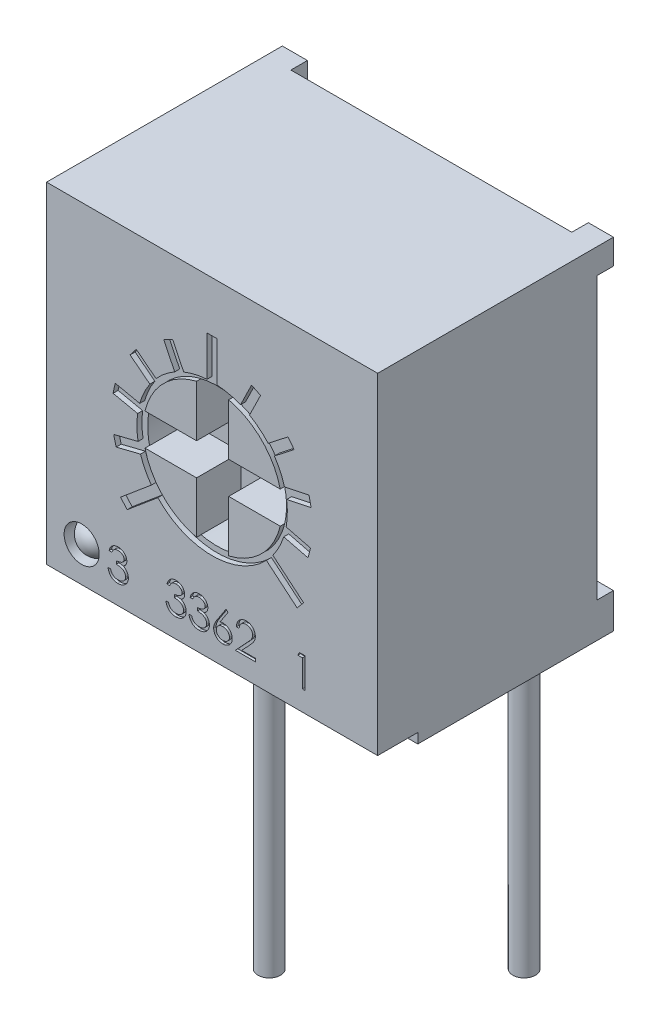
from build123d import *

# Parameters (mm, degrees)
SKETCH_1_W          = 6.6
SKETCH_1_H          = 6.6
EXTRUDE_1_DEPTH     = 4.7
SKETCH_2_R          = 1.385
CUT_EXTRUDE_1_DEPTH = 0.9
EXTRUDE_2_DEPTH     = 0.89
EXTRUDE_2_2_DEPTH   = 0.89
EXTRUDE_2_3_DEPTH   = 0.89
EXTRUDE_2_4_DEPTH   = 0.89
SKETCH_4_R          = 1.385
CUT_EXTRUDE_2_DEPTH = 0.1
SKETCH_6_R          = 0.35
CUT_EXTRUDE_3_DEPTH = 0.35
DOME_1_FACE_RADIUS  = 0.35
DOME_1_HEIGHT       = 0.35
SKETCH_13_W         = 0.53
SKETCH_13_H         = 3.9
SKETCH_13_W_2       = 2.08
EXTRUDE_4_DEPTH     = 0.2
SKETCH_14_W         = 1.04
SKETCH_14_H         = 3.9
EXTRUDE_5_DEPTH     = 0.254
SKETCH_8_W          = 5.6
SKETCH_8_H          = 0.33
CUT_EXTRUDE_4_DEPTH = 10.096093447
SKETCH_9_W          = 0.33
SKETCH_9_H          = 5.6
CUT_EXTRUDE_5_DEPTH = 9.929866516
CUT_EXTRUDE_6_DEPTH = 0.05
SKETCH_15_R         = 0.225
EXTRUDE_8_DEPTH     = 5.9
EXTRUDE_8_2_DEPTH   = 5.9
EXTRUDE_8_3_DEPTH   = 5.9


with BuildPart() as part:
    # Sketch 1 → Extrude 1 (new body)
    with BuildSketch(Plane.XY):
        Rectangle(SKETCH_1_W, SKETCH_1_H)
    extrude(amount=EXTRUDE_1_DEPTH)

    # Sketch 2 → Cut-Extrude 1 (cut)
    with BuildSketch(Plane.XY.offset(4.7)):
        Circle(SKETCH_2_R)
    extrude(amount=-CUT_EXTRUDE_1_DEPTH, mode=Mode.SUBTRACT)

    # Sketch 4 → Cut-Extrude 2 (cut)
    with BuildSketch(Plane.XY.offset(4.7)):
        with BuildLine():
            Line((-0.1, 2.296662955), (-0.1, 1.496662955))
            ThreePointArc((-0.1, 1.496662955), (-0.337426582, 1.461555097), (-0.566214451, 1.389028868))
            Line((-0.566214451, 1.389028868), (-0.785400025, 1.838425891))
            Line((-0.785400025, 1.838425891), (-0.965158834, 1.750751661))
            Line((-0.965158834, 1.750751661), (-0.74597326, 1.301354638))
            ThreePointArc((-0.74597326, 1.301354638), (-0.943980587, 1.165718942), (-1.117820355, 1.000238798))
            Line((-1.117820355, 1.000238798), (-1.511825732, 1.308069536))
            Line((-1.511825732, 1.308069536), (-1.634958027, 1.150467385))
            Line((-1.634958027, 1.150467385), (-1.24095265, 0.842636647))
            ThreePointArc((-1.24095265, 0.842636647), (-1.359461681, 0.633927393), (-1.443166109, 0.408988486))
            Line((-1.443166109, 0.408988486), (-1.93223991, 0.512944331))
            Line((-1.93223991, 0.512944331), (-1.973822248, 0.317314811))
            Line((-1.973822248, 0.317314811), (-1.484748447, 0.213358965))
            ThreePointArc((-1.484748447, 0.213358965), (-1.499771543, -0.02617861), (-1.476397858, -0.265045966))
            Line((-1.476397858, -0.265045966), (-1.961545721, -0.386006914))
            Line((-1.961545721, -0.386006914), (-1.913161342, -0.58006606))
            Line((-1.913161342, -0.58006606), (-1.428013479, -0.459105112))
            ThreePointArc((-1.428013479, -0.459105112), (-1.336509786, -0.68098575), (-1.210789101, -0.885431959))
            Line((-1.210789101, -0.885431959), (-1.823624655, -1.399662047))
            Line((-1.823624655, -1.399662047), (-1.695067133, -1.552870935))
            Line((-1.695067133, -1.552870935), (-1.082231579, -1.038640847))
            ThreePointArc((-1.082231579, -1.038640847), (0, -1.5), (1.082231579, -1.038640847))
            Line((1.082231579, -1.038640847), (1.695067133, -1.552870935))
            Line((1.695067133, -1.552870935), (1.823624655, -1.399662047))
            Line((1.823624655, -1.399662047), (1.210789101, -0.885431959))
            ThreePointArc((1.210789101, -0.885431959), (1.336509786, -0.68098575), (1.428013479, -0.459105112))
            Line((1.428013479, -0.459105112), (1.913161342, -0.58006606))
            Line((1.913161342, -0.58006606), (1.961545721, -0.386006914))
            Line((1.961545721, -0.386006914), (1.476397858, -0.265045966))
            ThreePointArc((1.476397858, -0.265045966), (1.499771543, -0.02617861), (1.484748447, 0.213358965))
            Line((1.484748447, 0.213358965), (1.973822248, 0.317314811))
            Line((1.973822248, 0.317314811), (1.93223991, 0.512944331))
            Line((1.93223991, 0.512944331), (1.443166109, 0.408988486))
            ThreePointArc((1.443166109, 0.408988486), (1.359461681, 0.633927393), (1.24095265, 0.842636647))
            Line((1.24095265, 0.842636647), (1.634958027, 1.150467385))
            Line((1.634958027, 1.150467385), (1.511825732, 1.308069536))
            Line((1.511825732, 1.308069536), (1.117820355, 1.000238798))
            ThreePointArc((1.117820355, 1.000238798), (0.943980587, 1.165718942), (0.74597326, 1.301354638))
            Line((0.74597326, 1.301354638), (0.965158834, 1.750751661))
            Line((0.965158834, 1.750751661), (0.785400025, 1.838425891))
            Line((0.785400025, 1.838425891), (0.566214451, 1.389028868))
            ThreePointArc((0.566214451, 1.389028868), (0.337426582, 1.461555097), (0.1, 1.496662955))
            Line((0.1, 1.496662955), (0.1, 2.296662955))
            Line((0.1, 2.296662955), (-0.1, 2.296662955))
        make_face()
        Circle(SKETCH_4_R, mode=Mode.SUBTRACT)
    extrude(amount=-CUT_EXTRUDE_2_DEPTH, mode=Mode.SUBTRACT)

    # Sketch 6 → Cut-Extrude 3 (cut)
    with BuildSketch(Plane.XY.offset(4.7)):
        with Locations((-2.6, -2.6)):
            Circle(SKETCH_6_R)
    extrude(amount=-CUT_EXTRUDE_3_DEPTH, mode=Mode.SUBTRACT)

    # Dome 1: a dome of height H over a round flat face of radius A is a cap of a sphere of radius (A * A + H * H) / (2 * H)
    dome_1_r = (DOME_1_FACE_RADIUS * DOME_1_FACE_RADIUS + DOME_1_HEIGHT * DOME_1_HEIGHT) / (2 * DOME_1_HEIGHT)
    dome_1_base = Plane((-2.6, -2.6, 4.35), z_dir=(0, 0, 1))
    with Locations(dome_1_base.offset(DOME_1_HEIGHT - dome_1_r)):
        dome_1_ball = Sphere(dome_1_r, mode=Mode.PRIVATE)
    add(split(dome_1_ball, bisect_by=dome_1_base, keep=Keep.TOP, mode=Mode.PRIVATE))

    # Sketch 13 → Extrude 4 (add)
    with BuildSketch(Plane.XZ.offset(3.3)):
        with Locations((-3.035, 1.95)):
            Rectangle(SKETCH_13_W, SKETCH_13_H)
        with Locations((-1.27, 1.95)):
            Rectangle(SKETCH_13_W_2, SKETCH_13_H)
        with Locations((1.27, 1.95)):
            Rectangle(SKETCH_13_W_2, SKETCH_13_H)
        with Locations((3.035, 1.95)):
            Rectangle(SKETCH_13_W, SKETCH_13_H)
    extrude(amount=EXTRUDE_4_DEPTH)

    # Sketch 14 → Extrude 5 (add)
    with BuildSketch(Plane(origin=(0, -3.5, 0), x_dir=(-1, 0, 0), z_dir=(0, -1, 0))):
        with Locations((1.79, -1.95)):
            Rectangle(SKETCH_14_W, SKETCH_14_H)
        with Locations((-1.79, -1.95)):
            Rectangle(SKETCH_14_W, SKETCH_14_H)
    extrude(amount=EXTRUDE_5_DEPTH)

    # Sketch 8 → Cut-Extrude 4 (cut, through all)
    with BuildSketch(Plane(origin=(0, 3.3, 0), x_dir=(1, 0, 0), z_dir=(0, 1, 0))):
        with Locations((0, -0.165)):
            Rectangle(SKETCH_8_W, SKETCH_8_H)
    extrude(amount=-CUT_EXTRUDE_4_DEPTH, mode=Mode.SUBTRACT)

    # Sketch 9 → Cut-Extrude 5 (cut, through all)
    with BuildSketch(Plane(origin=(3.3, 0, 0), x_dir=(0, 0, -1), z_dir=(1, 0, 0))):
        with Locations((-0.165, 0)):
            Rectangle(SKETCH_9_W, SKETCH_9_H)
    extrude(amount=-CUT_EXTRUDE_5_DEPTH, mode=Mode.SUBTRACT)

    # Sketch 11 → Cut-Extrude 6 (cut)
    # profile 1 of 6: a face of its own
    with BuildSketch(Plane.XY.offset(4.7)):
        with BuildLine():
            Line((-2, -2.438461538), (-2.053846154, -2.438461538))
            add(Edge.make_bspline(
                [(-2.053846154, -2.438461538), (-2.052387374, -2.432421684), (-2.049535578, -2.420614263), (-2.043587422, -2.403744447), (-2.03710755, -2.387780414), (-2.029326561, -2.373021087), (-2.020839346, -2.359169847), (-2.011115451, -2.346540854), (-2.000603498, -2.334812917), (-1.988976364, -2.324404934), (-1.976782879, -2.31498018), (-1.96385123, -2.306944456), (-1.950441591, -2.300031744), (-1.936461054, -2.294336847), (-1.921867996, -2.290046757), (-1.906794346, -2.286934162), (-1.891200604, -2.284912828), (-1.880615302, -2.284715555), (-1.875240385, -2.284615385)],
                knots=[0, 0, 0, 0, 1.162005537, 2.271625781, 3.343758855, 4.383309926, 5.390229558, 6.379919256, 7.361854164, 8.333198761, 9.295911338, 10.242430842, 11.177959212, 12.116337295, 13.062827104, 14.020064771, 14.994644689, 16, 16, 16, 16], degree=3))
            add(Edge.make_bspline(
                [(-1.875240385, -2.284615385), (-1.867409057, -2.284851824), (-1.851917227, -2.285319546), (-1.829157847, -2.289590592), (-1.807210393, -2.296349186), (-1.786315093, -2.305687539), (-1.766906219, -2.317205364), (-1.749637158, -2.330913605), (-1.734741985, -2.346547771), (-1.722245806, -2.36381621), (-1.712461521, -2.382271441), (-1.705246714, -2.401265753), (-1.700854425, -2.420754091), (-1.700285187, -2.433912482), (-1.7, -2.440504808)],
                knots=[0, 0, 0, 0, 1.083050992, 2.142477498, 3.193116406, 4.255571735, 5.30263384, 6.308962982, 7.297363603, 8.282367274, 9.249857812, 10.179914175, 11.08814088, 12, 12, 12, 12], degree=3))
            add(Edge.make_bspline(
                [(-1.7, -2.440504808), (-1.700199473, -2.44684883), (-1.70058981, -2.459263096), (-1.703904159, -2.477386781), (-1.709481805, -2.494468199), (-1.71720805, -2.510579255), (-1.727209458, -2.525617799), (-1.739324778, -2.539617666), (-1.75363952, -2.55264095), (-1.764487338, -2.560101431), (-1.770072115, -2.563942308)],
                knots=[0, 0, 0, 0, 1.024540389, 2.004866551, 2.965041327, 3.920577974, 4.882998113, 5.874504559, 6.905732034, 8, 8, 8, 8], degree=3))
            add(Edge.make_bspline(
                [(-1.770072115, -2.563942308), (-1.763689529, -2.56702428), (-1.751043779, -2.573130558), (-1.733806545, -2.585105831), (-1.71815891, -2.598932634), (-1.709432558, -2.609722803), (-1.705048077, -2.615144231)],
                knots=[0, 0, 0, 0, 1.015518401, 2.012035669, 3.001164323, 4, 4, 4, 4], degree=3))
            add(Edge.make_bspline(
                [(-1.705048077, -2.615144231), (-1.70216099, -2.619096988), (-1.696434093, -2.626937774), (-1.689365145, -2.639544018), (-1.682952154, -2.652289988), (-1.677954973, -2.665517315), (-1.674085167, -2.679072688), (-1.67131899, -2.692979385), (-1.669600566, -2.70724876), (-1.669354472, -2.716902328), (-1.669230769, -2.721754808)],
                knots=[0, 0, 0, 0, 1.025084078, 2.033381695, 3.024893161, 4.013698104, 4.991890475, 5.976764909, 6.982997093, 8, 8, 8, 8], degree=3))
            add(Edge.make_bspline(
                [(-1.669230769, -2.721754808), (-1.6695384, -2.730156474), (-1.670152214, -2.746920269), (-1.675638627, -2.771687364), (-1.684143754, -2.79589745), (-1.696222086, -2.819053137), (-1.71094223, -2.840718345), (-1.728454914, -2.860102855), (-1.748561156, -2.876765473), (-1.770984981, -2.890687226), (-1.795279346, -2.901816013), (-1.821263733, -2.909540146), (-1.848563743, -2.914570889), (-1.867284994, -2.915110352), (-1.876802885, -2.915384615)],
                knots=[0, 0, 0, 0, 0.955779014, 1.907060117, 2.875433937, 3.871313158, 4.872415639, 5.851225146, 6.836215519, 7.83643374, 8.849228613, 9.86973379, 10.916971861, 12, 12, 12, 12], degree=3))
            add(Edge.make_bspline(
                [(-1.876802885, -2.915384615), (-1.883217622, -2.915235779), (-1.895839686, -2.914942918), (-1.914395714, -2.912940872), (-1.932108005, -2.9092843), (-1.949000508, -2.904363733), (-1.965088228, -2.898125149), (-1.980322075, -2.890356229), (-1.994795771, -2.881217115), (-2.008372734, -2.870599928), (-2.021051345, -2.858723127), (-2.03249467, -2.845375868), (-2.042893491, -2.830804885), (-2.051969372, -2.814840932), (-2.060135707, -2.797690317), (-2.066852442, -2.779133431), (-2.072764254, -2.75933617), (-2.075512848, -2.745539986), (-2.076923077, -2.738461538)],
                knots=[0, 0, 0, 0, 1.048658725, 2.063410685, 3.046034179, 4.001477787, 4.936774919, 5.862367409, 6.792675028, 7.730719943, 8.675894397, 9.627829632, 10.600096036, 11.597688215, 12.626045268, 13.701542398, 14.82072376, 16, 16, 16, 16], degree=3))
            Line((-2.076923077, -2.738461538), (-2.023076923, -2.738461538))
            add(Edge.make_bspline(
                [(-2.023076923, -2.738461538), (-2.021674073, -2.743081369), (-2.018945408, -2.752067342), (-2.014300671, -2.764999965), (-2.009008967, -2.776855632), (-2.003332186, -2.78772131), (-1.997370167, -2.797704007), (-1.990699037, -2.806539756), (-1.983812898, -2.814616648), (-1.978622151, -2.819167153), (-1.976081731, -2.821394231)],
                knots=[0, 0, 0, 0, 1.198163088, 2.33053128, 3.407730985, 4.417276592, 5.372219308, 6.28897303, 7.162600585, 8, 8, 8, 8], degree=3))
            add(Edge.make_bspline(
                [(-1.976081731, -2.821394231), (-1.972722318, -2.823984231), (-1.966013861, -2.829156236), (-1.955082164, -2.835756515), (-1.943585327, -2.841475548), (-1.93127424, -2.845844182), (-1.918414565, -2.84954321), (-1.904798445, -2.85196387), (-1.890546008, -2.853624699), (-1.880814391, -2.853771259), (-1.875841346, -2.853846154)],
                knots=[0, 0, 0, 0, 0.946170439, 1.889420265, 2.845303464, 3.807233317, 4.801018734, 5.828864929, 6.890507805, 8, 8, 8, 8], degree=3))
            add(Edge.make_bspline(
                [(-1.875841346, -2.853846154), (-1.87022646, -2.85374057), (-1.859247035, -2.85353411), (-1.843226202, -2.851635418), (-1.827984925, -2.848870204), (-1.813692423, -2.844599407), (-1.800161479, -2.839322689), (-1.787581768, -2.832697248), (-1.77578815, -2.824923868), (-1.76493168, -2.816088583), (-1.755169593, -2.806416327), (-1.746574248, -2.7962998), (-1.739267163, -2.785781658), (-1.733372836, -2.774803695), (-1.728718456, -2.76341137), (-1.725549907, -2.751572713), (-1.72334679, -2.739384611), (-1.723167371, -2.731099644), (-1.723076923, -2.726923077)],
                knots=[0, 0, 0, 0, 1.217147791, 2.380027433, 3.494444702, 4.572153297, 5.609568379, 6.639424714, 7.649109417, 8.668170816, 9.669597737, 10.625200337, 11.543417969, 12.441394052, 13.322311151, 14.205496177, 15.095365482, 16, 16, 16, 16], degree=3))
            add(Edge.make_bspline(
                [(-1.723076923, -2.726923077), (-1.72333926, -2.721332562), (-1.72386263, -2.710179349), (-1.727858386, -2.693770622), (-1.734430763, -2.677960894), (-1.743631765, -2.663019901), (-1.754832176, -2.649172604), (-1.767923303, -2.636817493), (-1.783013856, -2.62662262), (-1.796902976, -2.61957885), (-1.809205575, -2.614772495), (-1.819733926, -2.611571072), (-1.831520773, -2.60886016), (-1.844423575, -2.606338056), (-1.858539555, -2.604191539), (-1.873853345, -2.602401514), (-1.890368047, -2.600969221), (-1.901800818, -2.600329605), (-1.907692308, -2.6)],
                knots=[0, 0, 0, 0, 1.07054697, 2.135767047, 3.216561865, 4.33974944, 5.486079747, 6.621378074, 7.775625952, 8.963672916, 9.598146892, 10.304877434, 11.070270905, 11.915000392, 12.823868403, 13.805723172, 14.86925407, 16, 16, 16, 16], degree=3))
            Line((-1.907692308, -2.6), (-1.907692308, -2.538461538))
            add(Edge.make_bspline(
                [(-1.907692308, -2.538461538), (-1.900269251, -2.538335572), (-1.885729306, -2.538088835), (-1.864490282, -2.535104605), (-1.844180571, -2.530976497), (-1.825250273, -2.524653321), (-1.807996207, -2.51730927), (-1.793027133, -2.508763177), (-1.780552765, -2.499263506), (-1.770633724, -2.48866363), (-1.76317157, -2.477295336), (-1.757715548, -2.465446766), (-1.754492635, -2.45301407), (-1.754062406, -2.44452927), (-1.753846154, -2.440264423)],
                knots=[0, 0, 0, 0, 1.321986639, 2.589447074, 3.816329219, 5.01088745, 6.139805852, 7.153945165, 8.075214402, 8.924034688, 9.728124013, 10.488707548, 11.240355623, 12, 12, 12, 12], degree=3))
            add(Edge.make_bspline(
                [(-1.753846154, -2.440264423), (-1.753917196, -2.437131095), (-1.75405853, -2.430897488), (-1.755840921, -2.421790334), (-1.758519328, -2.4129616), (-1.762201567, -2.404448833), (-1.767130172, -2.396311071), (-1.773028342, -2.388478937), (-1.780051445, -2.380997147), (-1.788099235, -2.374023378), (-1.796741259, -2.367377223), (-1.806212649, -2.361734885), (-1.816227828, -2.356910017), (-1.826797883, -2.352931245), (-1.837957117, -2.349938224), (-1.849653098, -2.347789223), (-1.861908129, -2.346445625), (-1.870268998, -2.346252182), (-1.874519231, -2.346153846)],
                knots=[0, 0, 0, 0, 0.884392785, 1.759457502, 2.611959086, 3.489218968, 4.37281399, 5.2945488, 6.255912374, 7.266815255, 8.301784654, 9.332968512, 10.37626691, 11.440494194, 12.520033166, 13.637162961, 14.798855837, 16, 16, 16, 16], degree=3))
            add(Edge.make_bspline(
                [(-1.874519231, -2.346153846), (-1.881350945, -2.346392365), (-1.894694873, -2.346858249), (-1.913931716, -2.350938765), (-1.93181503, -2.357449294), (-1.945484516, -2.365220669), (-1.955578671, -2.372892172), (-1.962791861, -2.379592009), (-1.969875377, -2.387037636), (-1.976363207, -2.395687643), (-1.98292446, -2.404956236), (-1.988897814, -2.415314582), (-1.994702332, -2.426492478), (-1.998199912, -2.434394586), (-2, -2.438461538)],
                knots=[0, 0, 0, 0, 1.472543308, 2.876219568, 4.221790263, 5.565193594, 6.249813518, 6.953379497, 7.687249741, 8.463570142, 9.283606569, 10.136032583, 11.040678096, 12, 12, 12, 12], degree=3))
        make_face()
    # profile 2 of 6: a face of its own
    with BuildSketch(Plane.XY.offset(4.7)):
        with BuildLine():
            Line((-0.846153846, -2.438461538), (-0.9, -2.438461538))
            add(Edge.make_bspline(
                [(-0.9, -2.438461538), (-0.89854122, -2.432421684), (-0.895689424, -2.420614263), (-0.889741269, -2.403744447), (-0.883261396, -2.387780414), (-0.875480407, -2.373021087), (-0.866993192, -2.359169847), (-0.857269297, -2.346540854), (-0.846757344, -2.334812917), (-0.83513021, -2.324404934), (-0.822936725, -2.31498018), (-0.810005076, -2.306944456), (-0.796595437, -2.300031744), (-0.7826149, -2.294336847), (-0.768021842, -2.290046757), (-0.752948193, -2.286934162), (-0.73735445, -2.284912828), (-0.726769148, -2.284715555), (-0.721394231, -2.284615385)],
                knots=[0, 0, 0, 0, 1.162005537, 2.271625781, 3.343758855, 4.383309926, 5.390229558, 6.379919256, 7.361854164, 8.333198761, 9.295911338, 10.242430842, 11.177959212, 12.116337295, 13.062827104, 14.020064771, 14.994644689, 16, 16, 16, 16], degree=3))
            add(Edge.make_bspline(
                [(-0.721394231, -2.284615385), (-0.713562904, -2.284851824), (-0.698071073, -2.285319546), (-0.675311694, -2.289590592), (-0.653364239, -2.296349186), (-0.632468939, -2.305687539), (-0.613060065, -2.317205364), (-0.595791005, -2.330913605), (-0.580895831, -2.346547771), (-0.568399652, -2.36381621), (-0.558615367, -2.382271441), (-0.55140056, -2.401265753), (-0.547008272, -2.420754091), (-0.546439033, -2.433912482), (-0.546153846, -2.440504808)],
                knots=[0, 0, 0, 0, 1.083050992, 2.142477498, 3.193116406, 4.255571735, 5.30263384, 6.308962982, 7.297363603, 8.282367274, 9.249857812, 10.179914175, 11.08814088, 12, 12, 12, 12], degree=3))
            add(Edge.make_bspline(
                [(-0.546153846, -2.440504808), (-0.546353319, -2.44684883), (-0.546743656, -2.459263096), (-0.550058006, -2.477386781), (-0.555635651, -2.494468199), (-0.563361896, -2.510579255), (-0.573363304, -2.525617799), (-0.585478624, -2.539617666), (-0.599793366, -2.55264095), (-0.610641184, -2.560101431), (-0.616225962, -2.563942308)],
                knots=[0, 0, 0, 0, 1.024540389, 2.004866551, 2.965041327, 3.920577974, 4.882998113, 5.874504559, 6.905732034, 8, 8, 8, 8], degree=3))
            add(Edge.make_bspline(
                [(-0.616225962, -2.563942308), (-0.609843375, -2.56702428), (-0.597197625, -2.573130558), (-0.579960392, -2.585105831), (-0.564312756, -2.598932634), (-0.555586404, -2.609722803), (-0.551201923, -2.615144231)],
                knots=[0, 0, 0, 0, 1.015518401, 2.012035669, 3.001164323, 4, 4, 4, 4], degree=3))
            add(Edge.make_bspline(
                [(-0.551201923, -2.615144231), (-0.548314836, -2.619096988), (-0.542587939, -2.626937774), (-0.535518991, -2.639544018), (-0.529106, -2.652289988), (-0.524108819, -2.665517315), (-0.520239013, -2.679072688), (-0.517472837, -2.692979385), (-0.515754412, -2.70724876), (-0.515508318, -2.716902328), (-0.515384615, -2.721754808)],
                knots=[0, 0, 0, 0, 1.025084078, 2.033381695, 3.024893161, 4.013698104, 4.991890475, 5.976764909, 6.982997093, 8, 8, 8, 8], degree=3))
            add(Edge.make_bspline(
                [(-0.515384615, -2.721754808), (-0.515692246, -2.730156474), (-0.51630606, -2.746920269), (-0.521792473, -2.771687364), (-0.5302976, -2.79589745), (-0.542375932, -2.819053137), (-0.557096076, -2.840718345), (-0.57460876, -2.860102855), (-0.594715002, -2.876765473), (-0.617138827, -2.890687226), (-0.641433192, -2.901816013), (-0.667417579, -2.909540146), (-0.694717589, -2.914570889), (-0.71343884, -2.915110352), (-0.722956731, -2.915384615)],
                knots=[0, 0, 0, 0, 0.955779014, 1.907060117, 2.875433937, 3.871313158, 4.872415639, 5.851225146, 6.836215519, 7.83643374, 8.849228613, 9.86973379, 10.916971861, 12, 12, 12, 12], degree=3))
            add(Edge.make_bspline(
                [(-0.722956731, -2.915384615), (-0.729371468, -2.915235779), (-0.741993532, -2.914942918), (-0.76054956, -2.912940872), (-0.778261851, -2.9092843), (-0.795154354, -2.904363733), (-0.811242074, -2.898125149), (-0.826475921, -2.890356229), (-0.840949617, -2.881217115), (-0.85452658, -2.870599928), (-0.867205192, -2.858723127), (-0.878648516, -2.845375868), (-0.889047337, -2.830804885), (-0.898123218, -2.814840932), (-0.906289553, -2.797690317), (-0.913006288, -2.779133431), (-0.9189181, -2.75933617), (-0.921666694, -2.745539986), (-0.923076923, -2.738461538)],
                knots=[0, 0, 0, 0, 1.048658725, 2.063410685, 3.046034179, 4.001477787, 4.936774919, 5.862367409, 6.792675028, 7.730719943, 8.675894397, 9.627829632, 10.600096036, 11.597688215, 12.626045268, 13.701542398, 14.82072376, 16, 16, 16, 16], degree=3))
            Line((-0.923076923, -2.738461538), (-0.869230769, -2.738461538))
            add(Edge.make_bspline(
                [(-0.869230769, -2.738461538), (-0.867827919, -2.743081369), (-0.865099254, -2.752067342), (-0.860454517, -2.764999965), (-0.855162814, -2.776855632), (-0.849486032, -2.78772131), (-0.843524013, -2.797704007), (-0.836852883, -2.806539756), (-0.829966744, -2.814616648), (-0.824775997, -2.819167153), (-0.822235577, -2.821394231)],
                knots=[0, 0, 0, 0, 1.198163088, 2.33053128, 3.407730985, 4.417276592, 5.372219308, 6.28897303, 7.162600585, 8, 8, 8, 8], degree=3))
            add(Edge.make_bspline(
                [(-0.822235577, -2.821394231), (-0.818876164, -2.823984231), (-0.812167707, -2.829156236), (-0.801236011, -2.835756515), (-0.789739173, -2.841475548), (-0.777428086, -2.845844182), (-0.764568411, -2.84954321), (-0.750952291, -2.85196387), (-0.736699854, -2.853624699), (-0.726968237, -2.853771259), (-0.721995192, -2.853846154)],
                knots=[0, 0, 0, 0, 0.946170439, 1.889420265, 2.845303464, 3.807233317, 4.801018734, 5.828864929, 6.890507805, 8, 8, 8, 8], degree=3))
            add(Edge.make_bspline(
                [(-0.721995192, -2.853846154), (-0.716380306, -2.85374057), (-0.705400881, -2.85353411), (-0.689380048, -2.851635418), (-0.674138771, -2.848870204), (-0.65984627, -2.844599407), (-0.646315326, -2.839322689), (-0.633735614, -2.832697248), (-0.621941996, -2.824923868), (-0.611085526, -2.816088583), (-0.601323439, -2.806416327), (-0.592728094, -2.7962998), (-0.585421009, -2.785781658), (-0.579526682, -2.774803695), (-0.574872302, -2.76341137), (-0.571703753, -2.751572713), (-0.569500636, -2.739384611), (-0.569321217, -2.731099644), (-0.569230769, -2.726923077)],
                knots=[0, 0, 0, 0, 1.217147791, 2.380027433, 3.494444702, 4.572153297, 5.609568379, 6.639424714, 7.649109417, 8.668170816, 9.669597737, 10.625200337, 11.543417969, 12.441394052, 13.322311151, 14.205496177, 15.095365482, 16, 16, 16, 16], degree=3))
            add(Edge.make_bspline(
                [(-0.569230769, -2.726923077), (-0.569493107, -2.721332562), (-0.570016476, -2.710179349), (-0.574012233, -2.693770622), (-0.580584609, -2.677960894), (-0.589785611, -2.663019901), (-0.600986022, -2.649172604), (-0.614077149, -2.636817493), (-0.629167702, -2.62662262), (-0.643056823, -2.61957885), (-0.655359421, -2.614772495), (-0.665887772, -2.611571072), (-0.677674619, -2.60886016), (-0.690577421, -2.606338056), (-0.704693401, -2.604191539), (-0.720007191, -2.602401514), (-0.736521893, -2.600969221), (-0.747954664, -2.600329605), (-0.753846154, -2.6)],
                knots=[0, 0, 0, 0, 1.07054697, 2.135767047, 3.216561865, 4.33974944, 5.486079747, 6.621378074, 7.775625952, 8.963672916, 9.598146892, 10.304877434, 11.070270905, 11.915000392, 12.823868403, 13.805723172, 14.86925407, 16, 16, 16, 16], degree=3))
            Line((-0.753846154, -2.6), (-0.753846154, -2.538461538))
            add(Edge.make_bspline(
                [(-0.753846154, -2.538461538), (-0.746423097, -2.538335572), (-0.731883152, -2.538088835), (-0.710644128, -2.535104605), (-0.690334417, -2.530976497), (-0.671404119, -2.524653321), (-0.654150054, -2.51730927), (-0.639180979, -2.508763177), (-0.626706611, -2.499263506), (-0.61678757, -2.48866363), (-0.609325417, -2.477295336), (-0.603869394, -2.465446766), (-0.600646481, -2.45301407), (-0.600216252, -2.44452927), (-0.6, -2.440264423)],
                knots=[0, 0, 0, 0, 1.321986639, 2.589447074, 3.816329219, 5.01088745, 6.139805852, 7.153945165, 8.075214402, 8.924034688, 9.728124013, 10.488707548, 11.240355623, 12, 12, 12, 12], degree=3))
            add(Edge.make_bspline(
                [(-0.6, -2.440264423), (-0.600071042, -2.437131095), (-0.600212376, -2.430897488), (-0.601994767, -2.421790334), (-0.604673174, -2.4129616), (-0.608355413, -2.404448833), (-0.613284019, -2.396311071), (-0.619182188, -2.388478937), (-0.626205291, -2.380997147), (-0.634253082, -2.374023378), (-0.642895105, -2.367377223), (-0.652366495, -2.361734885), (-0.662381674, -2.356910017), (-0.672951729, -2.352931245), (-0.684110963, -2.349938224), (-0.695806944, -2.347789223), (-0.708061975, -2.346445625), (-0.716422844, -2.346252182), (-0.720673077, -2.346153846)],
                knots=[0, 0, 0, 0, 0.884392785, 1.759457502, 2.611959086, 3.489218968, 4.37281399, 5.2945488, 6.255912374, 7.266815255, 8.301784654, 9.332968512, 10.37626691, 11.440494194, 12.520033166, 13.637162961, 14.798855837, 16, 16, 16, 16], degree=3))
            add(Edge.make_bspline(
                [(-0.720673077, -2.346153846), (-0.727504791, -2.346392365), (-0.740848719, -2.346858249), (-0.760085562, -2.350938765), (-0.777968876, -2.357449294), (-0.791638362, -2.365220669), (-0.801732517, -2.372892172), (-0.808945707, -2.379592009), (-0.816029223, -2.387037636), (-0.822517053, -2.395687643), (-0.829078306, -2.404956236), (-0.83505166, -2.415314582), (-0.840856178, -2.426492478), (-0.844353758, -2.434394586), (-0.846153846, -2.438461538)],
                knots=[0, 0, 0, 0, 1.472543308, 2.876219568, 4.221790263, 5.565193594, 6.249813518, 6.953379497, 7.687249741, 8.463570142, 9.283606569, 10.136032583, 11.040678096, 12, 12, 12, 12], degree=3))
        make_face()
    # profile 3 of 6: a face of its own
    with BuildSketch(Plane.XY.offset(4.7)):
        with BuildLine():
            Line((-0.384615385, -2.438461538), (-0.438461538, -2.438461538))
            add(Edge.make_bspline(
                [(-0.438461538, -2.438461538), (-0.437002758, -2.432421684), (-0.434150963, -2.420614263), (-0.428202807, -2.403744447), (-0.421722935, -2.387780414), (-0.413941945, -2.373021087), (-0.40545473, -2.359169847), (-0.395730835, -2.346540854), (-0.385218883, -2.334812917), (-0.373591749, -2.324404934), (-0.361398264, -2.31498018), (-0.348466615, -2.306944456), (-0.335056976, -2.300031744), (-0.321076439, -2.294336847), (-0.306483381, -2.290046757), (-0.291409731, -2.286934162), (-0.275815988, -2.284912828), (-0.265230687, -2.284715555), (-0.259855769, -2.284615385)],
                knots=[0, 0, 0, 0, 1.162005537, 2.271625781, 3.343758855, 4.383309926, 5.390229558, 6.379919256, 7.361854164, 8.333198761, 9.295911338, 10.242430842, 11.177959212, 12.116337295, 13.062827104, 14.020064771, 14.994644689, 16, 16, 16, 16], degree=3))
            add(Edge.make_bspline(
                [(-0.259855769, -2.284615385), (-0.252024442, -2.284851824), (-0.236532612, -2.285319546), (-0.213773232, -2.289590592), (-0.191825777, -2.296349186), (-0.170930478, -2.305687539), (-0.151521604, -2.317205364), (-0.134252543, -2.330913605), (-0.11935737, -2.346547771), (-0.106861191, -2.36381621), (-0.097076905, -2.382271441), (-0.089862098, -2.401265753), (-0.08546981, -2.420754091), (-0.084900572, -2.433912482), (-0.084615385, -2.440504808)],
                knots=[0, 0, 0, 0, 1.083050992, 2.142477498, 3.193116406, 4.255571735, 5.30263384, 6.308962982, 7.297363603, 8.282367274, 9.249857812, 10.179914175, 11.08814088, 12, 12, 12, 12], degree=3))
            add(Edge.make_bspline(
                [(-0.084615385, -2.440504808), (-0.084814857, -2.44684883), (-0.085205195, -2.459263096), (-0.088519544, -2.477386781), (-0.094097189, -2.494468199), (-0.101823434, -2.510579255), (-0.111824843, -2.525617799), (-0.123940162, -2.539617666), (-0.138254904, -2.55264095), (-0.149102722, -2.560101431), (-0.1546875, -2.563942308)],
                knots=[0, 0, 0, 0, 1.024540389, 2.004866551, 2.965041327, 3.920577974, 4.882998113, 5.874504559, 6.905732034, 8, 8, 8, 8], degree=3))
            add(Edge.make_bspline(
                [(-0.1546875, -2.563942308), (-0.148304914, -2.56702428), (-0.135659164, -2.573130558), (-0.11842193, -2.585105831), (-0.102774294, -2.598932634), (-0.094047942, -2.609722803), (-0.089663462, -2.615144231)],
                knots=[0, 0, 0, 0, 1.015518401, 2.012035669, 3.001164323, 4, 4, 4, 4], degree=3))
            add(Edge.make_bspline(
                [(-0.089663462, -2.615144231), (-0.086776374, -2.619096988), (-0.081049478, -2.626937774), (-0.073980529, -2.639544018), (-0.067567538, -2.652289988), (-0.062570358, -2.665517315), (-0.058700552, -2.679072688), (-0.055934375, -2.692979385), (-0.054215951, -2.70724876), (-0.053969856, -2.716902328), (-0.053846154, -2.721754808)],
                knots=[0, 0, 0, 0, 1.025084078, 2.033381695, 3.024893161, 4.013698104, 4.991890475, 5.976764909, 6.982997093, 8, 8, 8, 8], degree=3))
            add(Edge.make_bspline(
                [(-0.053846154, -2.721754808), (-0.054153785, -2.730156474), (-0.054767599, -2.746920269), (-0.060254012, -2.771687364), (-0.068759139, -2.79589745), (-0.08083747, -2.819053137), (-0.095557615, -2.840718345), (-0.113070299, -2.860102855), (-0.13317654, -2.876765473), (-0.155600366, -2.890687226), (-0.179894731, -2.901816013), (-0.205879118, -2.909540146), (-0.233179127, -2.914570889), (-0.251900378, -2.915110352), (-0.261418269, -2.915384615)],
                knots=[0, 0, 0, 0, 0.955779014, 1.907060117, 2.875433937, 3.871313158, 4.872415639, 5.851225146, 6.836215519, 7.83643374, 8.849228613, 9.86973379, 10.916971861, 12, 12, 12, 12], degree=3))
            add(Edge.make_bspline(
                [(-0.261418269, -2.915384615), (-0.267833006, -2.915235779), (-0.28045507, -2.914942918), (-0.299011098, -2.912940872), (-0.31672339, -2.9092843), (-0.333615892, -2.904363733), (-0.349703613, -2.898125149), (-0.364937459, -2.890356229), (-0.379411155, -2.881217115), (-0.392988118, -2.870599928), (-0.40566673, -2.858723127), (-0.417110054, -2.845375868), (-0.427508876, -2.830804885), (-0.436584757, -2.814840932), (-0.444751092, -2.797690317), (-0.451467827, -2.779133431), (-0.457379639, -2.75933617), (-0.460128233, -2.745539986), (-0.461538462, -2.738461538)],
                knots=[0, 0, 0, 0, 1.048658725, 2.063410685, 3.046034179, 4.001477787, 4.936774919, 5.862367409, 6.792675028, 7.730719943, 8.675894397, 9.627829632, 10.600096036, 11.597688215, 12.626045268, 13.701542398, 14.82072376, 16, 16, 16, 16], degree=3))
            Line((-0.461538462, -2.738461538), (-0.407692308, -2.738461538))
            add(Edge.make_bspline(
                [(-0.407692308, -2.738461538), (-0.406289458, -2.743081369), (-0.403560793, -2.752067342), (-0.398916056, -2.764999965), (-0.393624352, -2.776855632), (-0.387947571, -2.78772131), (-0.381985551, -2.797704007), (-0.375314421, -2.806539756), (-0.368428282, -2.814616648), (-0.363237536, -2.819167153), (-0.360697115, -2.821394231)],
                knots=[0, 0, 0, 0, 1.198163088, 2.33053128, 3.407730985, 4.417276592, 5.372219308, 6.28897303, 7.162600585, 8, 8, 8, 8], degree=3))
            add(Edge.make_bspline(
                [(-0.360697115, -2.821394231), (-0.357337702, -2.823984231), (-0.350629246, -2.829156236), (-0.339697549, -2.835756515), (-0.328200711, -2.841475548), (-0.315889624, -2.845844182), (-0.303029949, -2.84954321), (-0.28941383, -2.85196387), (-0.275161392, -2.853624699), (-0.265429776, -2.853771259), (-0.260456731, -2.853846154)],
                knots=[0, 0, 0, 0, 0.946170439, 1.889420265, 2.845303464, 3.807233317, 4.801018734, 5.828864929, 6.890507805, 8, 8, 8, 8], degree=3))
            add(Edge.make_bspline(
                [(-0.260456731, -2.853846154), (-0.254841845, -2.85374057), (-0.243862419, -2.85353411), (-0.227841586, -2.851635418), (-0.21260031, -2.848870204), (-0.198307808, -2.844599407), (-0.184776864, -2.839322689), (-0.172197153, -2.832697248), (-0.160403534, -2.824923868), (-0.149547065, -2.816088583), (-0.139784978, -2.806416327), (-0.131189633, -2.7962998), (-0.123882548, -2.785781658), (-0.11798822, -2.774803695), (-0.11333384, -2.76341137), (-0.110165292, -2.751572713), (-0.107962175, -2.739384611), (-0.107782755, -2.731099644), (-0.107692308, -2.726923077)],
                knots=[0, 0, 0, 0, 1.217147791, 2.380027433, 3.494444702, 4.572153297, 5.609568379, 6.639424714, 7.649109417, 8.668170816, 9.669597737, 10.625200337, 11.543417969, 12.441394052, 13.322311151, 14.205496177, 15.095365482, 16, 16, 16, 16], degree=3))
            add(Edge.make_bspline(
                [(-0.107692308, -2.726923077), (-0.107954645, -2.721332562), (-0.108478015, -2.710179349), (-0.112473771, -2.693770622), (-0.119046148, -2.677960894), (-0.12824715, -2.663019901), (-0.13944756, -2.649172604), (-0.152538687, -2.636817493), (-0.167629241, -2.62662262), (-0.181518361, -2.61957885), (-0.193820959, -2.614772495), (-0.204349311, -2.611571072), (-0.216136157, -2.60886016), (-0.22903896, -2.606338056), (-0.24315494, -2.604191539), (-0.258468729, -2.602401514), (-0.274983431, -2.600969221), (-0.286416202, -2.600329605), (-0.292307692, -2.6)],
                knots=[0, 0, 0, 0, 1.07054697, 2.135767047, 3.216561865, 4.33974944, 5.486079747, 6.621378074, 7.775625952, 8.963672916, 9.598146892, 10.304877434, 11.070270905, 11.915000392, 12.823868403, 13.805723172, 14.86925407, 16, 16, 16, 16], degree=3))
            Line((-0.292307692, -2.6), (-0.292307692, -2.538461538))
            add(Edge.make_bspline(
                [(-0.292307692, -2.538461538), (-0.284884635, -2.538335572), (-0.27034469, -2.538088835), (-0.249105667, -2.535104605), (-0.228795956, -2.530976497), (-0.209865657, -2.524653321), (-0.192611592, -2.51730927), (-0.177642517, -2.508763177), (-0.165168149, -2.499263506), (-0.155249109, -2.48866363), (-0.147786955, -2.477295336), (-0.142330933, -2.465446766), (-0.13910802, -2.45301407), (-0.138677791, -2.44452927), (-0.138461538, -2.440264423)],
                knots=[0, 0, 0, 0, 1.321986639, 2.589447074, 3.816329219, 5.01088745, 6.139805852, 7.153945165, 8.075214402, 8.924034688, 9.728124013, 10.488707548, 11.240355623, 12, 12, 12, 12], degree=3))
            add(Edge.make_bspline(
                [(-0.138461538, -2.440264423), (-0.13853258, -2.437131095), (-0.138673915, -2.430897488), (-0.140456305, -2.421790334), (-0.143134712, -2.4129616), (-0.146816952, -2.404448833), (-0.151745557, -2.396311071), (-0.157643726, -2.388478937), (-0.164666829, -2.380997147), (-0.17271462, -2.374023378), (-0.181356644, -2.367377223), (-0.190828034, -2.361734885), (-0.200843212, -2.356910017), (-0.211413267, -2.352931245), (-0.222572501, -2.349938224), (-0.234268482, -2.347789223), (-0.246523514, -2.346445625), (-0.254884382, -2.346252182), (-0.259134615, -2.346153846)],
                knots=[0, 0, 0, 0, 0.884392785, 1.759457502, 2.611959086, 3.489218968, 4.37281399, 5.2945488, 6.255912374, 7.266815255, 8.301784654, 9.332968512, 10.37626691, 11.440494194, 12.520033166, 13.637162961, 14.798855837, 16, 16, 16, 16], degree=3))
            add(Edge.make_bspline(
                [(-0.259134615, -2.346153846), (-0.26596633, -2.346392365), (-0.279310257, -2.346858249), (-0.2985471, -2.350938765), (-0.316430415, -2.357449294), (-0.3300999, -2.365220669), (-0.340194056, -2.372892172), (-0.347407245, -2.379592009), (-0.354490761, -2.387037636), (-0.360978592, -2.395687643), (-0.367539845, -2.404956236), (-0.373513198, -2.415314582), (-0.379317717, -2.426492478), (-0.382815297, -2.434394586), (-0.384615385, -2.438461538)],
                knots=[0, 0, 0, 0, 1.472543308, 2.876219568, 4.221790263, 5.565193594, 6.249813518, 6.953379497, 7.687249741, 8.463570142, 9.283606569, 10.136032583, 11.040678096, 12, 12, 12, 12], degree=3))
        make_face()
    # profile 4 of 6: a face of its own
    with BuildSketch(Plane.XY.offset(4.7)):
        with BuildLine():
            Line((0.276923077, -2.284615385), (0.318389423, -2.3171875))
            Line((0.318389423, -2.3171875), (0.159855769, -2.559615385))
            add(Edge.make_bspline(
                [(0.159855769, -2.559615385), (0.170410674, -2.557933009), (0.190999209, -2.554651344), (0.211839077, -2.554109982), (0.221995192, -2.553846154)],
                knots=[0, 0, 0, 0, 1.025318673, 2, 2, 2, 2], degree=3))
            add(Edge.make_bspline(
                [(0.221995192, -2.553846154), (0.228093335, -2.554010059), (0.240097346, -2.554332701), (0.257721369, -2.556815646), (0.274656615, -2.560728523), (0.290832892, -2.566432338), (0.30630826, -2.573718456), (0.321171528, -2.582450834), (0.335143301, -2.593080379), (0.348403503, -2.604954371), (0.360442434, -2.618105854), (0.371101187, -2.632060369), (0.380054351, -2.646803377), (0.387318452, -2.662327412), (0.392959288, -2.678608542), (0.397071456, -2.695625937), (0.399502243, -2.713391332), (0.399832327, -2.725473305), (0.4, -2.731610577)],
                knots=[0, 0, 0, 0, 1.04369286, 2.054478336, 3.041073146, 4.015093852, 4.984733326, 5.965804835, 6.960378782, 7.985147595, 9.009457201, 10.008161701, 10.986880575, 11.956520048, 12.937015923, 13.931873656, 14.949455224, 16, 16, 16, 16], degree=3))
            add(Edge.make_bspline(
                [(0.4, -2.731610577), (0.399756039, -2.740007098), (0.399275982, -2.756529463), (0.394492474, -2.780594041), (0.387059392, -2.803519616), (0.376434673, -2.824940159), (0.363237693, -2.844826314), (0.347144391, -2.862446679), (0.328725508, -2.878161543), (0.307899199, -2.891302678), (0.28548612, -2.902034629), (0.261940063, -2.909742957), (0.237489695, -2.914488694), (0.22089462, -2.915083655), (0.2125, -2.915384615)],
                knots=[0, 0, 0, 0, 1.031375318, 2.029502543, 3.004789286, 3.987476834, 4.960371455, 5.9300674, 6.912260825, 7.929083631, 8.949397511, 9.960523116, 10.96833055, 12, 12, 12, 12], degree=3))
            add(Edge.make_bspline(
                [(0.2125, -2.915384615), (0.20442628, -2.915122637), (0.188433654, -2.914603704), (0.164908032, -2.909980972), (0.142302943, -2.902488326), (0.120776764, -2.892165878), (0.100836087, -2.879127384), (0.082996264, -2.863430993), (0.067346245, -2.845412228), (0.054322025, -2.825073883), (0.043991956, -2.803218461), (0.036245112, -2.780429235), (0.031720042, -2.756789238), (0.031087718, -2.7407639), (0.030769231, -2.732692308)],
                knots=[0, 0, 0, 0, 1.012016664, 2.004627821, 2.994792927, 3.992885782, 4.990978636, 5.973936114, 6.964471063, 7.975201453, 8.993600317, 9.990122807, 10.98767138, 12, 12, 12, 12], degree=3))
            add(Edge.make_bspline(
                [(0.030769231, -2.732692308), (0.030971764, -2.726513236), (0.031385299, -2.713896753), (0.034272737, -2.694788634), (0.038912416, -2.67523702), (0.044108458, -2.658650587), (0.049598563, -2.645062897), (0.05416757, -2.634108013), (0.059854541, -2.622834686), (0.065918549, -2.610856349), (0.072905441, -2.598481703), (0.080502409, -2.585503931), (0.088919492, -2.572129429), (0.094820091, -2.563053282), (0.097836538, -2.558413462)],
                knots=[0, 0, 0, 0, 1.173818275, 2.396712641, 3.66331629, 4.989737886, 5.693666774, 6.447286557, 7.243889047, 8.091586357, 8.998013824, 9.943181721, 10.948533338, 12, 12, 12, 12], degree=3))
            Line((0.097836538, -2.558413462), (0.276923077, -2.284615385))
        make_face()
        with BuildLine():
            add(Edge.make_bspline(
                [(0.210697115, -2.615384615), (0.206126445, -2.615517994), (0.197198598, -2.615778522), (0.184100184, -2.617291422), (0.171703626, -2.620140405), (0.159844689, -2.623768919), (0.148745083, -2.628758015), (0.138324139, -2.634818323), (0.128541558, -2.641953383), (0.119499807, -2.65006211), (0.11130215, -2.658940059), (0.104242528, -2.66844912), (0.098152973, -2.678360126), (0.093201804, -2.688755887), (0.089346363, -2.69963243), (0.08655752, -2.71093973), (0.085005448, -2.722753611), (0.084747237, -2.730764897), (0.084615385, -2.734855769)],
                knots=[0, 0, 0, 0, 1.129588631, 2.206414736, 3.251139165, 4.268635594, 5.265702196, 6.250456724, 7.242448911, 8.251968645, 9.246821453, 10.222880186, 11.173611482, 12.116736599, 13.062300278, 14.020270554, 14.989073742, 16, 16, 16, 16], degree=3))
            add(Edge.make_bspline(
                [(0.084615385, -2.734855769), (0.084722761, -2.738910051), (0.08493331, -2.746859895), (0.086845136, -2.758575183), (0.089765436, -2.769849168), (0.094109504, -2.780623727), (0.099291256, -2.791063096), (0.106132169, -2.800789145), (0.113712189, -2.810392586), (0.122772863, -2.819135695), (0.132496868, -2.827271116), (0.142885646, -2.834382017), (0.153713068, -2.840465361), (0.165125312, -2.845232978), (0.176960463, -2.849145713), (0.189317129, -2.851899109), (0.202203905, -2.853455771), (0.21093338, -2.853714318), (0.215384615, -2.853846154)],
                knots=[0, 0, 0, 0, 0.989467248, 1.94019797, 2.891935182, 3.827694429, 4.772920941, 5.730924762, 6.725747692, 7.756678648, 8.79901574, 9.819492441, 10.826891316, 11.826466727, 12.835195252, 13.867842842, 14.912794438, 16, 16, 16, 16], degree=3))
            add(Edge.make_bspline(
                [(0.215384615, -2.853846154), (0.219835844, -2.853714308), (0.228565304, -2.85345574), (0.241452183, -2.851899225), (0.253808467, -2.849145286), (0.265645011, -2.845234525), (0.277052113, -2.840459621), (0.287870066, -2.834419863), (0.298160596, -2.827227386), (0.307890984, -2.819149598), (0.316913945, -2.810342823), (0.324675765, -2.800874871), (0.331307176, -2.790984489), (0.336695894, -2.780664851), (0.340992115, -2.769842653), (0.343927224, -2.758576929), (0.345835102, -2.746859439), (0.346046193, -2.738909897), (0.346153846, -2.734855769)],
                knots=[0, 0, 0, 0, 1.087397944, 2.132534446, 3.165364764, 4.174271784, 5.174024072, 6.181601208, 7.194203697, 8.236725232, 9.267838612, 10.269026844, 11.221737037, 12.171628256, 13.107553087, 14.05945871, 15.010357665, 16, 16, 16, 16], degree=3))
            add(Edge.make_bspline(
                [(0.346153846, -2.734855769), (0.34605951, -2.730759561), (0.345874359, -2.722720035), (0.343780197, -2.710945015), (0.34087579, -2.699574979), (0.336490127, -2.688681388), (0.330792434, -2.678307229), (0.323852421, -2.668400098), (0.315823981, -2.658884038), (0.306550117, -2.650044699), (0.296454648, -2.641962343), (0.285720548, -2.634827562), (0.27449061, -2.628806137), (0.262776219, -2.623782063), (0.250443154, -2.620156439), (0.237690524, -2.617301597), (0.224355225, -2.615782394), (0.215307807, -2.615518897), (0.210697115, -2.615384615)],
                knots=[0, 0, 0, 0, 0.978206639, 1.919901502, 2.851605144, 3.780102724, 4.718870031, 5.675451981, 6.667674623, 7.690630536, 8.733308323, 9.756129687, 10.767539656, 11.776269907, 12.797430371, 13.836405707, 14.897401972, 16, 16, 16, 16], degree=3))
        make_face(mode=Mode.SUBTRACT)
    # profile 5 of 6: a face of its own
    with BuildSketch(Plane.XY.offset(4.7)):
        with BuildLine():
            Line((0.538461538, -2.484615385), (0.484615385, -2.484615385))
            add(Edge.make_bspline(
                [(0.484615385, -2.484615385), (0.484966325, -2.477471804), (0.485655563, -2.463442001), (0.48888327, -2.442986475), (0.493501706, -2.423434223), (0.500031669, -2.404942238), (0.508141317, -2.387347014), (0.517866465, -2.37071844), (0.52938541, -2.35511995), (0.542449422, -2.340696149), (0.556638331, -2.327463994), (0.571947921, -2.316037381), (0.58803564, -2.306382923), (0.60485268, -2.298311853), (0.622588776, -2.292253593), (0.641082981, -2.287758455), (0.660416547, -2.285053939), (0.673589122, -2.284763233), (0.680288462, -2.284615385)],
                knots=[0, 0, 0, 0, 1.10065271, 2.161652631, 3.183658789, 4.190468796, 5.17591951, 6.163126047, 7.15150782, 8.156236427, 9.156009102, 10.134482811, 11.092018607, 12.041330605, 13.001268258, 13.972401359, 14.968799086, 16, 16, 16, 16], degree=3))
            add(Edge.make_bspline(
                [(0.680288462, -2.284615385), (0.68686756, -2.284769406), (0.699795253, -2.285072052), (0.718663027, -2.287671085), (0.736624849, -2.291741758), (0.753645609, -2.297452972), (0.769589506, -2.305130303), (0.784576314, -2.314352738), (0.798784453, -2.325018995), (0.811574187, -2.337576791), (0.823318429, -2.350982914), (0.833450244, -2.365295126), (0.842126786, -2.38007729), (0.84935896, -2.395442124), (0.85468287, -2.411534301), (0.858724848, -2.428119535), (0.861009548, -2.445369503), (0.861360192, -2.457044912), (0.861538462, -2.462980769)],
                knots=[0, 0, 0, 0, 1.111607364, 2.184268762, 3.212621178, 4.221274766, 5.211760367, 6.196651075, 7.1921475, 8.207485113, 9.220403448, 10.201281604, 11.166441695, 12.114753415, 13.065576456, 14.026450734, 14.996634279, 16, 16, 16, 16], degree=3))
            add(Edge.make_bspline(
                [(0.861538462, -2.462980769), (0.861248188, -2.471337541), (0.860672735, -2.487904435), (0.85575027, -2.51224984), (0.848062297, -2.535837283), (0.838805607, -2.55482082), (0.829467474, -2.570117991), (0.821052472, -2.582712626), (0.811201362, -2.596273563), (0.799770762, -2.610755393), (0.786997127, -2.626271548), (0.772764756, -2.642812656), (0.756972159, -2.660207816), (0.745887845, -2.672088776), (0.740144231, -2.678245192)],
                knots=[0, 0, 0, 0, 1.184426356, 2.348067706, 3.509069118, 4.696110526, 5.333549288, 6.050745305, 6.844228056, 7.710549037, 8.667450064, 9.695053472, 10.805634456, 12, 12, 12, 12], degree=3))
            Line((0.740144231, -2.678245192), (0.590024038, -2.838461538))
            Line((0.590024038, -2.838461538), (0.869230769, -2.838461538))
            Line((0.869230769, -2.838461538), (0.869230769, -2.9))
            Line((0.869230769, -2.9), (0.461538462, -2.9))
            Line((0.461538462, -2.9), (0.694230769, -2.651682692))
            add(Edge.make_bspline(
                [(0.694230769, -2.651682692), (0.699896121, -2.645768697), (0.710778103, -2.634409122), (0.726169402, -2.617824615), (0.739993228, -2.602438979), (0.752339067, -2.588281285), (0.762939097, -2.575144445), (0.772345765, -2.563453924), (0.779882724, -2.552696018), (0.788062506, -2.540226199), (0.795984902, -2.52500123), (0.802792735, -2.506395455), (0.806943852, -2.487242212), (0.807441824, -2.474299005), (0.807692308, -2.467788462)],
                knots=[0, 0, 0, 0, 1.329631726, 2.553950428, 3.673215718, 4.687767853, 5.603093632, 6.413772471, 7.123043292, 7.734684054, 8.834405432, 9.900288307, 10.943827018, 12, 12, 12, 12], degree=3))
            add(Edge.make_bspline(
                [(0.807692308, -2.467788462), (0.807583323, -2.463694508), (0.807368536, -2.45562611), (0.805472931, -2.443796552), (0.802608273, -2.432385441), (0.798503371, -2.421357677), (0.793085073, -2.410824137), (0.786489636, -2.400771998), (0.778879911, -2.391053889), (0.770076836, -2.381941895), (0.76040629, -2.373596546), (0.750190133, -2.366203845), (0.739381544, -2.360025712), (0.728026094, -2.354961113), (0.716155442, -2.35098819), (0.703746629, -2.348235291), (0.69083394, -2.346506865), (0.68201677, -2.346273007), (0.677524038, -2.346153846)],
                knots=[0, 0, 0, 0, 0.991446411, 1.95395049, 2.89581595, 3.838931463, 4.798493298, 5.75982156, 6.748411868, 7.785213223, 8.824556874, 9.840280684, 10.836137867, 11.835679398, 12.848801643, 13.863922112, 14.911575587, 16, 16, 16, 16], degree=3))
            add(Edge.make_bspline(
                [(0.677524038, -2.346153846), (0.672831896, -2.346276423), (0.663617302, -2.346517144), (0.650088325, -2.348201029), (0.637182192, -2.35110603), (0.624866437, -2.355079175), (0.613120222, -2.360129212), (0.602000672, -2.366419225), (0.591532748, -2.373924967), (0.581696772, -2.382434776), (0.572634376, -2.391909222), (0.564672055, -2.40247093), (0.557714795, -2.413927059), (0.551644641, -2.426246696), (0.546715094, -2.43954163), (0.542948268, -2.453764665), (0.539967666, -2.468854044), (0.538971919, -2.479274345), (0.538461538, -2.484615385)],
                knots=[0, 0, 0, 0, 1.031018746, 2.02475058, 2.990194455, 3.934040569, 4.864654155, 5.795059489, 6.735614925, 7.690564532, 8.649604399, 9.611025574, 10.590972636, 11.591080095, 12.624614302, 13.701020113, 14.821632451, 16, 16, 16, 16], degree=3))
        make_face()
    # profile 6 of 6: a face of its own
    with BuildSketch(Plane.XY.offset(4.7)):
        Polygon((1.742908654, -2.3), (1.853846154, -2.3), (1.853846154, -2.9), (1.8, -2.9), (1.8, -2.361538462), (1.707692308, -2.361538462), align=None)
    extrude(amount=-CUT_EXTRUDE_6_DEPTH, mode=Mode.SUBTRACT)


with BuildPart() as body_2:
    # Sketch 3 → Extrude 2 (new body)
    with BuildSketch(Plane.XY.offset(3.8)):
        with BuildLine():
            Line((-0.32, 1.34752551), (-0.32, 0.32))
            Line((-0.32, 0.32), (-1.34752551, 0.32))
            ThreePointArc((-1.34752551, 0.32), (-0.979342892, 0.979342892), (-0.32, 1.34752551))
        make_face()
    extrude(amount=EXTRUDE_2_DEPTH)


with BuildPart() as body_3:
    # Sketch 3 → Extrude 2 2 (new body)
    with BuildSketch(Plane.XY.offset(3.8)):
        with BuildLine():
            Line((0.32, 1.34752551), (0.32, 0.32))
            Line((0.32, 0.32), (1.34752551, 0.32))
            ThreePointArc((1.34752551, 0.32), (0.979342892, 0.979342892), (0.32, 1.34752551))
        make_face()
    extrude(amount=EXTRUDE_2_2_DEPTH)


with BuildPart() as body_4:
    # Sketch 3 → Extrude 2 3 (new body)
    with BuildSketch(Plane.XY.offset(3.8)):
        with BuildLine():
            Line((-1.34752551, -0.32), (-0.32, -0.32))
            Line((-0.32, -0.32), (-0.32, -1.34752551))
            ThreePointArc((-0.32, -1.34752551), (-0.979342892, -0.979342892), (-1.34752551, -0.32))
        make_face()
    extrude(amount=EXTRUDE_2_3_DEPTH)


with BuildPart() as body_5:
    # Sketch 3 → Extrude 2 4 (new body)
    with BuildSketch(Plane.XY.offset(3.8)):
        with BuildLine():
            Line((0.32, -0.32), (1.34752551, -0.32))
            ThreePointArc((1.34752551, -0.32), (0.979342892, -0.979342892), (0.32, -1.34752551))
            Line((0.32, -1.34752551), (0.32, -0.32))
        make_face()
    extrude(amount=EXTRUDE_2_4_DEPTH)


with BuildPart() as body_6:
    # Sketch 15 → Extrude 8 (new body)
    with BuildSketch(Plane.XZ.offset(3.3)):
        with Locations(Location((0, 3.56, 0), (0, 0, 270))):
            Circle(SKETCH_15_R)
    extrude(amount=EXTRUDE_8_DEPTH)


with BuildPart() as body_7:
    # Sketch 15 → Extrude 8 2 (new body)
    with BuildSketch(Plane.XZ.offset(3.3)):
        with Locations(Location((-2.54, 1.02, 0), (0, 0, 270))):
            Circle(SKETCH_15_R)
    extrude(amount=EXTRUDE_8_2_DEPTH)


with BuildPart() as body_8:
    # Sketch 15 → Extrude 8 3 (new body)
    with BuildSketch(Plane.XZ.offset(3.3)):
        with Locations(Location((2.54, 1.02, 0), (0, 0, 270))):
            Circle(SKETCH_15_R)
    extrude(amount=EXTRUDE_8_3_DEPTH)


solid = Compound([part.part, body_2.part, body_3.part, body_4.part, body_5.part, body_6.part, body_7.part, body_8.part])
